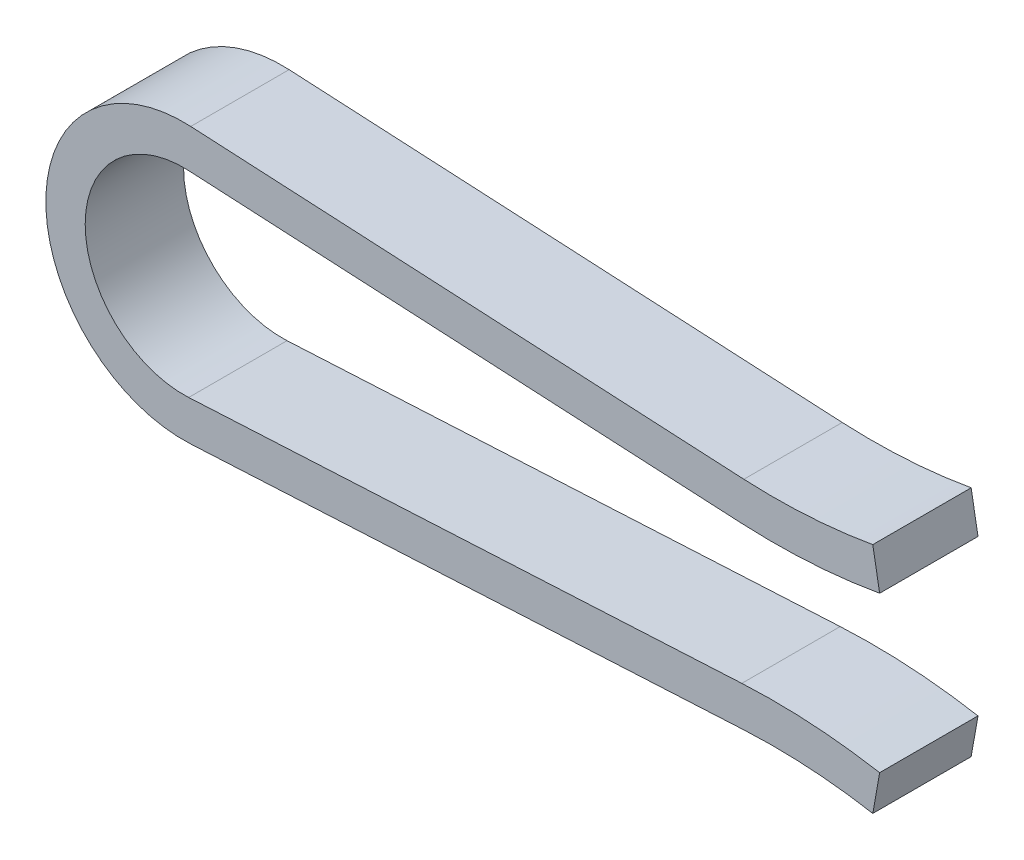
ISO-10303-21;
HEADER;
FILE_DESCRIPTION(('STEP AP214'),'2;1');
FILE_NAME('part.step','',(''),(''),'','','');
FILE_SCHEMA(('AUTOMOTIVE_DESIGN { 1 0 10303 214 1 1 1 1 }'));
ENDSEC;
DATA;
#1=APPLICATION_CONTEXT('core data for automotive mechanical design processes');
#2=APPLICATION_PROTOCOL_DEFINITION('international standard','automotive_design',2000,#1);
#3=PRODUCT_CONTEXT('',#1,'mechanical');
#4=PRODUCT('Part','Part','',(#3));
#5=PRODUCT_RELATED_PRODUCT_CATEGORY('part','',(#4));
#6=PRODUCT_DEFINITION_FORMATION('','',#4);
#7=PRODUCT_DEFINITION_CONTEXT('part definition',#1,'design');
#8=PRODUCT_DEFINITION('design','',#6,#7);
#9=PRODUCT_DEFINITION_SHAPE('','',#8);
#10=(LENGTH_UNIT() NAMED_UNIT(*) SI_UNIT(.MILLI.,.METRE.));
#11=(NAMED_UNIT(*) PLANE_ANGLE_UNIT() SI_UNIT($,.RADIAN.));
#12=(NAMED_UNIT(*) SI_UNIT($,.STERADIAN.) SOLID_ANGLE_UNIT());
#13=UNCERTAINTY_MEASURE_WITH_UNIT(LENGTH_MEASURE(1.E-05),#10,'distance_accuracy_value','');
#14=(GEOMETRIC_REPRESENTATION_CONTEXT(3) GLOBAL_UNCERTAINTY_ASSIGNED_CONTEXT((#13)) GLOBAL_UNIT_ASSIGNED_CONTEXT((#10,
#11,#12)) REPRESENTATION_CONTEXT('',''));
#15=CARTESIAN_POINT('',(0.,0.,0.));
#16=DIRECTION('',(0.,0.,1.));
#17=DIRECTION('',(1.,0.,0.));
#18=AXIS2_PLACEMENT_3D('',#15,#16,#17);
#19=CARTESIAN_POINT('',(30.,34.4771710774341,0.));
#20=DIRECTION('',(0.,0.,1.));
#21=DIRECTION('',(1.,0.,0.));
#22=AXIS2_PLACEMENT_3D('',#19,#20,#21);
#23=CYLINDRICAL_SURFACE('',#22,31.);
#24=DIRECTION('',(0.,0.,1.));
#25=VECTOR('',#24,1.);
#26=CARTESIAN_POINT('',(28.377585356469,3.51965550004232,-2.5));
#27=LINE('',#26,#25);
#28=CARTESIAN_POINT('',(28.377585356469,3.51965550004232,-2.5));
#29=VERTEX_POINT('',#28);
#30=CARTESIAN_POINT('',(28.377585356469,3.51965550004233,2.5));
#31=VERTEX_POINT('',#30);
#32=EDGE_CURVE('E199',#29,#31,#27,.T.);
#33=ORIENTED_EDGE('',*,*,#32,.F.);
#34=CARTESIAN_POINT('',(30.,34.4771710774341,-2.5));
#35=DIRECTION('',(0.,0.,1.));
#36=DIRECTION('',(1.,0.,0.));
#37=AXIS2_PLACEMENT_3D('',#34,#35,#36);
#38=CIRCLE('',#37,31.);
#39=CARTESIAN_POINT('',(35.3830935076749,3.94813073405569,-2.5));
#40=VERTEX_POINT('',#39);
#41=EDGE_CURVE('E40',#29,#40,#38,.T.);
#42=ORIENTED_EDGE('',*,*,#41,.T.);
#43=DIRECTION('',(0.,0.,1.));
#44=VECTOR('',#43,1.);
#45=CARTESIAN_POINT('',(35.3830935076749,3.94813073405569,-2.5));
#46=LINE('',#45,#44);
#47=CARTESIAN_POINT('',(35.3830935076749,3.94813073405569,2.5));
#48=VERTEX_POINT('',#47);
#49=EDGE_CURVE('E47',#40,#48,#46,.T.);
#50=ORIENTED_EDGE('',*,*,#49,.T.);
#51=CARTESIAN_POINT('',(30.,34.4771710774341,2.5));
#52=DIRECTION('',(0.,0.,1.));
#53=DIRECTION('',(1.,0.,0.));
#54=AXIS2_PLACEMENT_3D('',#51,#52,#53);
#55=CIRCLE('',#54,31.);
#56=EDGE_CURVE('E11',#31,#48,#55,.T.);
#57=ORIENTED_EDGE('',*,*,#56,.F.);
#58=EDGE_LOOP('',(#33,#42,#50,#57));
#59=FACE_BOUND('',#58,.T.);
#60=ADVANCED_FACE('F33',(#59),#23,.T.);
#61=CARTESIAN_POINT('',(30.,34.4771710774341,0.));
#62=DIRECTION('',(0.,0.,1.));
#63=DIRECTION('',(1.,0.,0.));
#64=AXIS2_PLACEMENT_3D('',#61,#62,#63);
#65=CYLINDRICAL_SURFACE('',#64,29.);
#66=DIRECTION('',(0.,0.,-1.));
#67=VECTOR('',#66,1.);
#68=CARTESIAN_POINT('',(28.4822572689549,5.51691456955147,-2.5));
#69=LINE('',#68,#67);
#70=CARTESIAN_POINT('',(28.4822572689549,5.51691456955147,2.5));
#71=VERTEX_POINT('',#70);
#72=CARTESIAN_POINT('',(28.4822572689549,5.51691456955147,-2.5));
#73=VERTEX_POINT('',#72);
#74=EDGE_CURVE('E196',#71,#73,#69,.T.);
#75=ORIENTED_EDGE('',*,*,#74,.F.);
#76=CARTESIAN_POINT('',(30.,34.4771710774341,2.5));
#77=DIRECTION('',(0.,0.,1.));
#78=DIRECTION('',(1.,0.,0.));
#79=AXIS2_PLACEMENT_3D('',#76,#77,#78);
#80=CIRCLE('',#79,29.);
#81=CARTESIAN_POINT('',(35.0357971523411,5.91774624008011,2.5));
#82=VERTEX_POINT('',#81);
#83=EDGE_CURVE('E220',#71,#82,#80,.T.);
#84=ORIENTED_EDGE('',*,*,#83,.T.);
#85=DIRECTION('',(0.,0.,-1.));
#86=VECTOR('',#85,1.);
#87=CARTESIAN_POINT('',(35.0357971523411,5.91774624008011,-2.5));
#88=LINE('',#87,#86);
#89=CARTESIAN_POINT('',(35.0357971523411,5.91774624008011,-2.5));
#90=VERTEX_POINT('',#89);
#91=EDGE_CURVE('E216',#82,#90,#88,.T.);
#92=ORIENTED_EDGE('',*,*,#91,.T.);
#93=CARTESIAN_POINT('',(30.,34.4771710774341,-2.5));
#94=DIRECTION('',(0.,0.,1.));
#95=DIRECTION('',(1.,0.,0.));
#96=AXIS2_PLACEMENT_3D('',#93,#94,#95);
#97=CIRCLE('',#96,29.);
#98=EDGE_CURVE('E223',#73,#90,#97,.T.);
#99=ORIENTED_EDGE('',*,*,#98,.F.);
#100=EDGE_LOOP('',(#75,#84,#92,#99));
#101=FACE_BOUND('',#100,.T.);
#102=ADVANCED_FACE('F243',(#101),#65,.F.);
#103=CARTESIAN_POINT('',(0.261679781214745,4.99314767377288,-2.5));
#104=DIRECTION('',(0.0523359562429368,0.998629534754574,0.));
#105=DIRECTION('',(-0.998629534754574,0.0523359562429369,0.));
#106=AXIS2_PLACEMENT_3D('',#103,#104,#105);
#107=PLANE('',#106);
#108=DIRECTION('',(0.,0.,1.));
#109=VECTOR('',#108,1.);
#110=CARTESIAN_POINT('',(0.261679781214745,4.99314767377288,-2.5));
#111=LINE('',#110,#109);
#112=CARTESIAN_POINT('',(0.261679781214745,4.99314767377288,-2.5));
#113=VERTEX_POINT('',#112);
#114=CARTESIAN_POINT('',(0.261679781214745,4.99314767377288,2.5));
#115=VERTEX_POINT('',#114);
#116=EDGE_CURVE('E181',#113,#115,#111,.T.);
#117=ORIENTED_EDGE('',*,*,#116,.F.);
#118=DIRECTION('',(0.998629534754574,-0.0523359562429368,0.));
#119=VECTOR('',#118,1.);
#120=CARTESIAN_POINT('',(0.261679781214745,4.99314767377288,-2.5));
#121=LINE('',#120,#119);
#122=EDGE_CURVE('E208',#113,#29,#121,.T.);
#123=ORIENTED_EDGE('',*,*,#122,.T.);
#124=ORIENTED_EDGE('',*,*,#32,.T.);
#125=DIRECTION('',(0.998629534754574,-0.0523359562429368,0.));
#126=VECTOR('',#125,1.);
#127=CARTESIAN_POINT('',(0.261679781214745,4.99314767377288,2.5));
#128=LINE('',#127,#126);
#129=EDGE_CURVE('E211',#115,#31,#128,.T.);
#130=ORIENTED_EDGE('',*,*,#129,.F.);
#131=EDGE_LOOP('',(#117,#123,#124,#130));
#132=FACE_BOUND('',#131,.T.);
#133=ADVANCED_FACE('F229',(#132),#107,.F.);
#134=CARTESIAN_POINT('',(0.366351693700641,6.99040674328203,-2.5));
#135=DIRECTION('',(-0.0523359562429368,-0.998629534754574,0.));
#136=DIRECTION('',(0.998629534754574,-0.0523359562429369,0.));
#137=AXIS2_PLACEMENT_3D('',#134,#135,#136);
#138=PLANE('',#137);
#139=DIRECTION('',(0.,0.,-1.));
#140=VECTOR('',#139,1.);
#141=CARTESIAN_POINT('',(0.366351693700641,6.99040674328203,-2.5));
#142=LINE('',#141,#140);
#143=CARTESIAN_POINT('',(0.366351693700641,6.99040674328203,2.5));
#144=VERTEX_POINT('',#143);
#145=CARTESIAN_POINT('',(0.366351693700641,6.99040674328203,-2.5));
#146=VERTEX_POINT('',#145);
#147=EDGE_CURVE('E178',#144,#146,#142,.T.);
#148=ORIENTED_EDGE('',*,*,#147,.F.);
#149=DIRECTION('',(0.998629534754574,-0.0523359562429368,0.));
#150=VECTOR('',#149,1.);
#151=CARTESIAN_POINT('',(0.366351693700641,6.99040674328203,2.5));
#152=LINE('',#151,#150);
#153=EDGE_CURVE('E202',#144,#71,#152,.T.);
#154=ORIENTED_EDGE('',*,*,#153,.T.);
#155=ORIENTED_EDGE('',*,*,#74,.T.);
#156=DIRECTION('',(0.998629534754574,-0.0523359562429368,0.));
#157=VECTOR('',#156,1.);
#158=CARTESIAN_POINT('',(0.366351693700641,6.99040674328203,-2.5));
#159=LINE('',#158,#157);
#160=EDGE_CURVE('E205',#146,#73,#159,.T.);
#161=ORIENTED_EDGE('',*,*,#160,.F.);
#162=EDGE_LOOP('',(#148,#154,#155,#161));
#163=FACE_BOUND('',#162,.T.);
#164=ADVANCED_FACE('F246',(#163),#138,.F.);
#165=CARTESIAN_POINT('',(0.,0.,0.));
#166=DIRECTION('',(0.,0.,-1.));
#167=DIRECTION('',(-1.,0.,0.));
#168=AXIS2_PLACEMENT_3D('',#165,#166,#167);
#169=CYLINDRICAL_SURFACE('',#168,5.00000000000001);
#170=DIRECTION('',(0.,0.,1.));
#171=VECTOR('',#170,1.);
#172=CARTESIAN_POINT('',(0.261679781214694,-4.99314767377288,-2.5));
#173=LINE('',#172,#171);
#174=CARTESIAN_POINT('',(0.261679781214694,-4.99314767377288,-2.5));
#175=VERTEX_POINT('',#174);
#176=CARTESIAN_POINT('',(0.261679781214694,-4.99314767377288,2.5));
#177=VERTEX_POINT('',#176);
#178=EDGE_CURVE('E165',#175,#177,#173,.T.);
#179=ORIENTED_EDGE('',*,*,#178,.F.);
#180=CARTESIAN_POINT('',(0.,0.,-2.5));
#181=DIRECTION('',(0.,0.,-1.));
#182=DIRECTION('',(-1.,0.,0.));
#183=AXIS2_PLACEMENT_3D('',#180,#181,#182);
#184=CIRCLE('',#183,5.00000000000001);
#185=EDGE_CURVE('E190',#175,#113,#184,.T.);
#186=ORIENTED_EDGE('',*,*,#185,.T.);
#187=ORIENTED_EDGE('',*,*,#116,.T.);
#188=CARTESIAN_POINT('',(0.,0.,2.5));
#189=DIRECTION('',(0.,0.,-1.));
#190=DIRECTION('',(-1.,0.,0.));
#191=AXIS2_PLACEMENT_3D('',#188,#189,#190);
#192=CIRCLE('',#191,5.00000000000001);
#193=EDGE_CURVE('E193',#177,#115,#192,.T.);
#194=ORIENTED_EDGE('',*,*,#193,.F.);
#195=EDGE_LOOP('',(#179,#186,#187,#194));
#196=FACE_BOUND('',#195,.T.);
#197=ADVANCED_FACE('F231',(#196),#169,.F.);
#198=CARTESIAN_POINT('',(0.,0.,0.));
#199=DIRECTION('',(0.,0.,-1.));
#200=DIRECTION('',(-1.,0.,0.));
#201=AXIS2_PLACEMENT_3D('',#198,#199,#200);
#202=CYLINDRICAL_SURFACE('',#201,7.00000000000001);
#203=DIRECTION('',(0.,0.,-1.));
#204=VECTOR('',#203,1.);
#205=CARTESIAN_POINT('',(0.366351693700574,-6.99040674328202,-2.5));
#206=LINE('',#205,#204);
#207=CARTESIAN_POINT('',(0.366351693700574,-6.99040674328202,2.5));
#208=VERTEX_POINT('',#207);
#209=CARTESIAN_POINT('',(0.366351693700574,-6.99040674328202,-2.5));
#210=VERTEX_POINT('',#209);
#211=EDGE_CURVE('E134',#208,#210,#206,.T.);
#212=ORIENTED_EDGE('',*,*,#211,.F.);
#213=CARTESIAN_POINT('',(0.,0.,2.5));
#214=DIRECTION('',(0.,0.,-1.));
#215=DIRECTION('',(-1.,0.,0.));
#216=AXIS2_PLACEMENT_3D('',#213,#214,#215);
#217=CIRCLE('',#216,7.00000000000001);
#218=EDGE_CURVE('E184',#208,#144,#217,.T.);
#219=ORIENTED_EDGE('',*,*,#218,.T.);
#220=ORIENTED_EDGE('',*,*,#147,.T.);
#221=CARTESIAN_POINT('',(0.,0.,-2.5));
#222=DIRECTION('',(0.,0.,-1.));
#223=DIRECTION('',(-1.,0.,0.));
#224=AXIS2_PLACEMENT_3D('',#221,#222,#223);
#225=CIRCLE('',#224,7.00000000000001);
#226=EDGE_CURVE('E187',#210,#146,#225,.T.);
#227=ORIENTED_EDGE('',*,*,#226,.F.);
#228=EDGE_LOOP('',(#212,#219,#220,#227));
#229=FACE_BOUND('',#228,.T.);
#230=ADVANCED_FACE('F249',(#229),#202,.T.);
#231=CARTESIAN_POINT('',(28.3775853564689,-3.51965550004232,-2.5));
#232=DIRECTION('',(0.0523359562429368,-0.998629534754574,0.));
#233=DIRECTION('',(0.998629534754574,0.0523359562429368,0.));
#234=AXIS2_PLACEMENT_3D('',#231,#232,#233);
#235=PLANE('',#234);
#236=DIRECTION('',(0.,0.,1.));
#237=VECTOR('',#236,1.);
#238=CARTESIAN_POINT('',(28.3775853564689,-3.51965550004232,-2.5));
#239=LINE('',#238,#237);
#240=CARTESIAN_POINT('',(28.3775853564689,-3.51965550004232,-2.5));
#241=VERTEX_POINT('',#240);
#242=CARTESIAN_POINT('',(28.3775853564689,-3.51965550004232,2.5));
#243=VERTEX_POINT('',#242);
#244=EDGE_CURVE('E155',#241,#243,#239,.T.);
#245=ORIENTED_EDGE('',*,*,#244,.F.);
#246=DIRECTION('',(-0.998629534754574,-0.0523359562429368,0.));
#247=VECTOR('',#246,1.);
#248=CARTESIAN_POINT('',(28.3775853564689,-3.51965550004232,-2.5));
#249=LINE('',#248,#247);
#250=EDGE_CURVE('E172',#241,#175,#249,.T.);
#251=ORIENTED_EDGE('',*,*,#250,.T.);
#252=ORIENTED_EDGE('',*,*,#178,.T.);
#253=DIRECTION('',(-0.998629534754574,-0.0523359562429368,0.));
#254=VECTOR('',#253,1.);
#255=CARTESIAN_POINT('',(28.3775853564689,-3.51965550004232,2.5));
#256=LINE('',#255,#254);
#257=EDGE_CURVE('E175',#243,#177,#256,.T.);
#258=ORIENTED_EDGE('',*,*,#257,.F.);
#259=EDGE_LOOP('',(#245,#251,#252,#258));
#260=FACE_BOUND('',#259,.T.);
#261=ADVANCED_FACE('F234',(#260),#235,.F.);
#262=CARTESIAN_POINT('',(28.4822572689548,-5.51691456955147,-2.5));
#263=DIRECTION('',(-0.0523359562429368,0.998629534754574,0.));
#264=DIRECTION('',(-0.998629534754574,-0.0523359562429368,0.));
#265=AXIS2_PLACEMENT_3D('',#262,#263,#264);
#266=PLANE('',#265);
#267=DIRECTION('',(0.,0.,-1.));
#268=VECTOR('',#267,1.);
#269=CARTESIAN_POINT('',(28.4822572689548,-5.51691456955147,-2.5));
#270=LINE('',#269,#268);
#271=CARTESIAN_POINT('',(28.4822572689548,-5.51691456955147,2.5));
#272=VERTEX_POINT('',#271);
#273=CARTESIAN_POINT('',(28.4822572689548,-5.51691456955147,-2.5));
#274=VERTEX_POINT('',#273);
#275=EDGE_CURVE('E153',#272,#274,#270,.T.);
#276=ORIENTED_EDGE('',*,*,#275,.F.);
#277=DIRECTION('',(-0.998629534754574,-0.0523359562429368,0.));
#278=VECTOR('',#277,1.);
#279=CARTESIAN_POINT('',(28.4822572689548,-5.51691456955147,2.5));
#280=LINE('',#279,#278);
#281=EDGE_CURVE('E129',#272,#208,#280,.T.);
#282=ORIENTED_EDGE('',*,*,#281,.T.);
#283=ORIENTED_EDGE('',*,*,#211,.T.);
#284=DIRECTION('',(-0.998629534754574,-0.0523359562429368,0.));
#285=VECTOR('',#284,1.);
#286=CARTESIAN_POINT('',(28.4822572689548,-5.51691456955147,-2.5));
#287=LINE('',#286,#285);
#288=EDGE_CURVE('E169',#274,#210,#287,.T.);
#289=ORIENTED_EDGE('',*,*,#288,.F.);
#290=EDGE_LOOP('',(#276,#282,#283,#289));
#291=FACE_BOUND('',#290,.T.);
#292=ADVANCED_FACE('F251',(#291),#266,.F.);
#293=CARTESIAN_POINT('',(28.3775853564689,-3.51965550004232,2.5));
#294=DIRECTION('',(0.,0.,1.));
#295=DIRECTION('',(1.,0.,0.));
#296=AXIS2_PLACEMENT_3D('',#293,#294,#295);
#297=PLANE('',#296);
#298=CARTESIAN_POINT('',(30.,-34.4771710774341,2.5));
#299=DIRECTION('',(0.,0.,-1.));
#300=DIRECTION('',(-1.,0.,0.));
#301=AXIS2_PLACEMENT_3D('',#298,#299,#300);
#302=CIRCLE('',#301,29.);
#303=CARTESIAN_POINT('',(35.035797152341,-5.9177462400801,2.5));
#304=VERTEX_POINT('',#303);
#305=EDGE_CURVE('E122',#272,#304,#302,.T.);
#306=ORIENTED_EDGE('',*,*,#305,.T.);
#307=DIRECTION('',(-0.173648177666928,-0.984807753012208,0.));
#308=VECTOR('',#307,1.);
#309=CARTESIAN_POINT('',(35.3830935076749,-3.94813073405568,2.5));
#310=LINE('',#309,#308);
#311=CARTESIAN_POINT('',(35.3830935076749,-3.94813073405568,2.5));
#312=VERTEX_POINT('',#311);
#313=EDGE_CURVE('E126',#312,#304,#310,.T.);
#314=ORIENTED_EDGE('',*,*,#313,.F.);
#315=CARTESIAN_POINT('',(30.,-34.4771710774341,2.5));
#316=DIRECTION('',(0.,0.,-1.));
#317=DIRECTION('',(-1.,0.,0.));
#318=AXIS2_PLACEMENT_3D('',#315,#316,#317);
#319=CIRCLE('',#318,31.);
#320=EDGE_CURVE('E158',#243,#312,#319,.T.);
#321=ORIENTED_EDGE('',*,*,#320,.F.);
#322=ORIENTED_EDGE('',*,*,#257,.T.);
#323=ORIENTED_EDGE('',*,*,#193,.T.);
#324=ORIENTED_EDGE('',*,*,#129,.T.);
#325=ORIENTED_EDGE('',*,*,#56,.T.);
#326=DIRECTION('',(-0.17364817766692,0.98480775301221,0.));
#327=VECTOR('',#326,1.);
#328=CARTESIAN_POINT('',(35.3830935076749,3.94813073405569,2.5));
#329=LINE('',#328,#327);
#330=EDGE_CURVE('E214',#48,#82,#329,.T.);
#331=ORIENTED_EDGE('',*,*,#330,.T.);
#332=ORIENTED_EDGE('',*,*,#83,.F.);
#333=ORIENTED_EDGE('',*,*,#153,.F.);
#334=ORIENTED_EDGE('',*,*,#218,.F.);
#335=ORIENTED_EDGE('',*,*,#281,.F.);
#336=EDGE_LOOP('',(#306,#314,#321,#322,#323,#324,#325,#331,#332,#333,#334,#335));
#337=FACE_BOUND('',#336,.T.);
#338=ADVANCED_FACE('F124',(#337),#297,.T.);
#339=CARTESIAN_POINT('',(30.,-34.4771710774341,0.));
#340=DIRECTION('',(0.,0.,-1.));
#341=DIRECTION('',(-1.,0.,0.));
#342=AXIS2_PLACEMENT_3D('',#339,#340,#341);
#343=CYLINDRICAL_SURFACE('',#342,29.);
#344=CARTESIAN_POINT('',(30.,-34.4771710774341,-2.5));
#345=DIRECTION('',(0.,0.,-1.));
#346=DIRECTION('',(-1.,0.,0.));
#347=AXIS2_PLACEMENT_3D('',#344,#345,#346);
#348=CIRCLE('',#347,29.);
#349=CARTESIAN_POINT('',(35.035797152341,-5.9177462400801,-2.5));
#350=VERTEX_POINT('',#349);
#351=EDGE_CURVE('E135',#274,#350,#348,.T.);
#352=ORIENTED_EDGE('',*,*,#351,.T.);
#353=DIRECTION('',(0.,0.,-1.));
#354=VECTOR('',#353,1.);
#355=CARTESIAN_POINT('',(35.035797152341,-5.9177462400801,-2.5));
#356=LINE('',#355,#354);
#357=EDGE_CURVE('E141',#304,#350,#356,.T.);
#358=ORIENTED_EDGE('',*,*,#357,.F.);
#359=ORIENTED_EDGE('',*,*,#305,.F.);
#360=ORIENTED_EDGE('',*,*,#275,.T.);
#361=EDGE_LOOP('',(#352,#358,#359,#360));
#362=FACE_BOUND('',#361,.T.);
#363=ADVANCED_FACE('F146',(#362),#343,.F.);
#364=CARTESIAN_POINT('',(28.3775853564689,-3.51965550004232,-2.5));
#365=DIRECTION('',(0.,0.,-1.));
#366=DIRECTION('',(-1.,0.,0.));
#367=AXIS2_PLACEMENT_3D('',#364,#365,#366);
#368=PLANE('',#367);
#369=CARTESIAN_POINT('',(30.,-34.4771710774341,-2.5));
#370=DIRECTION('',(0.,0.,-1.));
#371=DIRECTION('',(-1.,0.,0.));
#372=AXIS2_PLACEMENT_3D('',#369,#370,#371);
#373=CIRCLE('',#372,31.);
#374=CARTESIAN_POINT('',(35.3830935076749,-3.94813073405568,-2.5));
#375=VERTEX_POINT('',#374);
#376=EDGE_CURVE('E160',#241,#375,#373,.T.);
#377=ORIENTED_EDGE('',*,*,#376,.T.);
#378=DIRECTION('',(0.173648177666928,0.984807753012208,0.));
#379=VECTOR('',#378,1.);
#380=CARTESIAN_POINT('',(35.3830935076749,-3.94813073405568,-2.5));
#381=LINE('',#380,#379);
#382=EDGE_CURVE('E148',#350,#375,#381,.T.);
#383=ORIENTED_EDGE('',*,*,#382,.F.);
#384=ORIENTED_EDGE('',*,*,#351,.F.);
#385=ORIENTED_EDGE('',*,*,#288,.T.);
#386=ORIENTED_EDGE('',*,*,#226,.T.);
#387=ORIENTED_EDGE('',*,*,#160,.T.);
#388=ORIENTED_EDGE('',*,*,#98,.T.);
#389=DIRECTION('',(0.17364817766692,-0.98480775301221,0.));
#390=VECTOR('',#389,1.);
#391=CARTESIAN_POINT('',(35.3830935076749,3.94813073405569,-2.5));
#392=LINE('',#391,#390);
#393=EDGE_CURVE('E55',#90,#40,#392,.T.);
#394=ORIENTED_EDGE('',*,*,#393,.T.);
#395=ORIENTED_EDGE('',*,*,#41,.F.);
#396=ORIENTED_EDGE('',*,*,#122,.F.);
#397=ORIENTED_EDGE('',*,*,#185,.F.);
#398=ORIENTED_EDGE('',*,*,#250,.F.);
#399=EDGE_LOOP('',(#377,#383,#384,#385,#386,#387,#388,#394,#395,#396,#397,#398));
#400=FACE_BOUND('',#399,.T.);
#401=ADVANCED_FACE('F225',(#400),#368,.T.);
#402=CARTESIAN_POINT('',(30.,-34.4771710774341,0.));
#403=DIRECTION('',(0.,0.,-1.));
#404=DIRECTION('',(-1.,0.,0.));
#405=AXIS2_PLACEMENT_3D('',#402,#403,#404);
#406=CYLINDRICAL_SURFACE('',#405,31.);
#407=ORIENTED_EDGE('',*,*,#244,.T.);
#408=ORIENTED_EDGE('',*,*,#320,.T.);
#409=DIRECTION('',(0.,0.,1.));
#410=VECTOR('',#409,1.);
#411=CARTESIAN_POINT('',(35.3830935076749,-3.94813073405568,-2.5));
#412=LINE('',#411,#410);
#413=EDGE_CURVE('E144',#375,#312,#412,.T.);
#414=ORIENTED_EDGE('',*,*,#413,.F.);
#415=ORIENTED_EDGE('',*,*,#376,.F.);
#416=EDGE_LOOP('',(#407,#408,#414,#415));
#417=FACE_BOUND('',#416,.T.);
#418=ADVANCED_FACE('F237',(#417),#406,.T.);
#419=CARTESIAN_POINT('',(35.0357971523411,5.91774624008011,2.5));
#420=DIRECTION('',(0.98480775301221,0.17364817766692,0.));
#421=DIRECTION('',(-0.17364817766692,0.98480775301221,0.));
#422=AXIS2_PLACEMENT_3D('',#419,#420,#421);
#423=PLANE('',#422);
#424=ORIENTED_EDGE('',*,*,#330,.F.);
#425=ORIENTED_EDGE('',*,*,#49,.F.);
#426=ORIENTED_EDGE('',*,*,#393,.F.);
#427=ORIENTED_EDGE('',*,*,#91,.F.);
#428=EDGE_LOOP('',(#424,#425,#426,#427));
#429=FACE_BOUND('',#428,.T.);
#430=ADVANCED_FACE('F241',(#429),#423,.T.);
#431=CARTESIAN_POINT('',(35.035797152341,-5.9177462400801,2.5));
#432=DIRECTION('',(-0.984807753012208,0.173648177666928,0.));
#433=DIRECTION('',(-0.173648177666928,-0.984807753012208,0.));
#434=AXIS2_PLACEMENT_3D('',#431,#432,#433);
#435=PLANE('',#434);
#436=ORIENTED_EDGE('',*,*,#313,.T.);
#437=ORIENTED_EDGE('',*,*,#357,.T.);
#438=ORIENTED_EDGE('',*,*,#382,.T.);
#439=ORIENTED_EDGE('',*,*,#413,.T.);
#440=EDGE_LOOP('',(#436,#437,#438,#439));
#441=FACE_BOUND('',#440,.T.);
#442=ADVANCED_FACE('F139',(#441),#435,.F.);
#443=CLOSED_SHELL('',(#60,#102,#133,#164,#197,#230,#261,#292,#338,#363,#401,#418,#430,#442));
#444=MANIFOLD_SOLID_BREP('B2',#443);
#445=ADVANCED_BREP_SHAPE_REPRESENTATION('',(#18,#444),#14);
#446=SHAPE_DEFINITION_REPRESENTATION(#9,#445);
ENDSEC;
END-ISO-10303-21;
